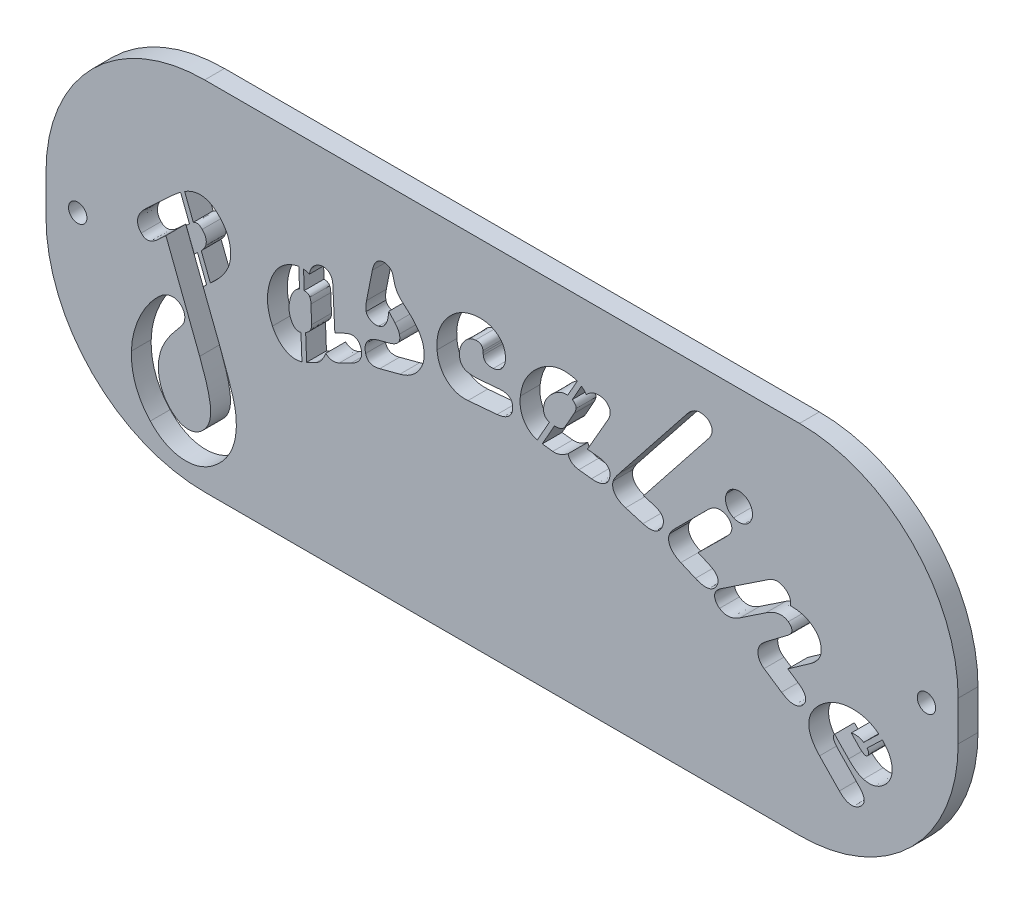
from build123d import *

# Parameters (mm, degrees)
SKETCH1_W                 = 146.05
SKETCH1_H                 = 57.15
BOSS_EXTRUDE1_DEPTH       = 3.175
F_4_CLEARANCE_HOLE1_D     = 2.9464
F_4_CLEARANCE_HOLE1_DEPTH = 3.302
CUT_EXTRUDE3_DEPTH        = 157.865565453
BOSS_EXTRUDE2_DEPTH       = 3.175
FILLET1_R                 = 25.4


with BuildPart() as part:
    # Sketch1 → Boss-Extrude1 (new body)
    with BuildSketch(Plane.XY):
        with Locations((73.025, 28.575)):
            Rectangle(SKETCH1_W, SKETCH1_H)
    extrude(amount=BOSS_EXTRUDE1_DEPTH)

    # 4 Clearance Hole1
    with Locations(Plane(origin=(-66.675, -37.192315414, 3.175), x_dir=(1, 0, 0), z_dir=(0, 0, 1))):
        with Locations((71.755, 65.767315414), (207.645, 65.767315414)):
            Hole(F_4_CLEARANCE_HOLE1_D / 2, depth=F_4_CLEARANCE_HOLE1_DEPTH)

    # Sketch4 → Cut-Extrude3 (cut, through all)
    # profile 1 of 10: a face of its own
    with BuildSketch(Plane.XY.offset(3.175)):
        with BuildLine():
            Line((25.159109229, 28.355996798), (27.774034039, 21.614245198))
            add(Edge.make_bspline(
                [(27.774034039, 21.614245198), (27.928592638, 21.212021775), (28.22559931, 20.43909137), (28.639687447, 19.321879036), (29.005343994, 18.294136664), (29.330097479, 17.356375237), (29.610885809, 16.508972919), (29.845041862, 15.74957907), (30.036613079, 15.082912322), (30.227486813, 14.317114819), (30.398002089, 13.419954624), (30.482906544, 12.356269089), (30.487862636, 11.29527412), (30.399752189, 10.596161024), (30.355677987, 10.246453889)],
                knots=[0, 0, 0, 0, 1.315063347, 2.527084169, 3.636212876, 4.644213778, 5.555804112, 6.360533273, 7.069422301, 7.672385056, 8.769052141, 9.851548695, 10.925311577, 12, 12, 12, 12], degree=3))
            add(Edge.make_bspline(
                [(30.355677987, 10.246453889), (30.313050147, 9.993388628), (30.228806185, 9.493264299), (30.017336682, 8.766558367), (29.758929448, 8.064648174), (29.43110879, 7.392389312), (29.052764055, 6.7446787), (28.609879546, 6.12761609), (28.112160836, 5.536003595), (27.739166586, 5.172080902), (27.550576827, 4.988077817)],
                knots=[0, 0, 0, 0, 1.012748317, 2.001460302, 2.983832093, 3.963628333, 4.951210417, 5.942929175, 6.959923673, 8, 8, 8, 8], degree=3))
            add(Edge.make_bspline(
                [(27.550576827, 4.988077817), (27.344473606, 4.805234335), (26.941194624, 4.447467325), (26.294794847, 3.984047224), (25.632578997, 3.597315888), (24.952060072, 3.283198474), (24.253038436, 3.052200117), (23.538346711, 2.890383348), (22.80592522, 2.818305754), (22.06392788, 2.811778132), (21.322927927, 2.88308937), (20.59732186, 3.029797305), (19.89430284, 3.256873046), (19.210023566, 3.552419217), (18.546341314, 3.926312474), (17.904960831, 4.375579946), (17.281095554, 4.895773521), (16.897263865, 5.290319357), (16.701016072, 5.492045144)],
                knots=[0, 0, 0, 0, 1.082409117, 2.117933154, 3.120093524, 4.092919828, 5.058157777, 6.008813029, 6.967091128, 7.945108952, 8.92135959, 9.887702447, 10.849073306, 11.819983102, 12.81286572, 13.837597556, 14.894393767, 16, 16, 16, 16], degree=3))
            add(Edge.make_bspline(
                [(16.701016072, 5.492045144), (16.449000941, 5.775385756), (15.95076111, 6.335556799), (15.321022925, 7.257251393), (14.781420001, 8.215712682), (14.354234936, 9.224777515), (14.023624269, 10.277085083), (13.796504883, 11.374147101), (13.66842817, 12.517522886), (13.671098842, 13.293713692), (13.672457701, 13.68864582)],
                knots=[0, 0, 0, 0, 1.013454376, 2.0036231, 2.979089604, 3.951566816, 4.929021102, 5.925080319, 6.944264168, 8, 8, 8, 8], degree=3))
            add(Edge.make_bspline(
                [(13.672457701, 13.68864582), (13.695132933, 14.125689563), (13.74107588, 15.011196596), (14.009816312, 16.336112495), (14.396218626, 17.675928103), (14.84885246, 18.777846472), (15.268306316, 19.649996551), (15.609048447, 20.284781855), (15.973267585, 20.894455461), (16.36055615, 21.475079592), (16.771537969, 22.03179843), (17.209066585, 22.556291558), (17.664195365, 23.059560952), (17.989127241, 23.370506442), (18.151110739, 23.525517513)],
                knots=[0, 0, 0, 0, 1.420880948, 2.878888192, 4.381990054, 5.949030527, 6.74398471, 7.527674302, 8.290164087, 9.051748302, 9.795685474, 10.538426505, 11.271383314, 12, 12, 12, 12], degree=3))
            add(Edge.make_bspline(
                [(18.151110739, 23.525517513), (18.305740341, 23.662119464), (18.601380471, 23.923292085), (19.087989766, 24.219471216), (19.573683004, 24.428991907), (20.060437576, 24.527115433), (20.530947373, 24.539662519), (20.97079938, 24.435677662), (21.374646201, 24.233766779), (21.591669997, 24.026253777), (21.702654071, 23.920133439)],
                knots=[0, 0, 0, 0, 1.236261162, 2.363638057, 3.404192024, 4.394848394, 5.327151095, 6.206300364, 7.082717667, 8, 8, 8, 8], degree=3))
            add(Edge.make_bspline(
                [(21.702654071, 23.920133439), (21.804705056, 23.796225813), (22.004335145, 23.553840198), (22.183440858, 23.114517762), (22.248128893, 22.637895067), (22.202014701, 22.317621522), (22.178094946, 22.151493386)],
                knots=[0, 0, 0, 0, 1.006687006, 1.969260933, 2.946641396, 4, 4, 4, 4], degree=3))
            add(Edge.make_bspline(
                [(22.178094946, 22.151493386), (22.145426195, 22.040604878), (22.071353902, 21.789179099), (21.848054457, 21.405112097), (21.529045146, 20.967538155), (21.272362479, 20.66629593), (21.132125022, 20.501713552)],
                knots=[0, 0, 0, 0, 0.701886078, 1.591438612, 2.684092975, 4, 4, 4, 4], degree=3))
            add(Edge.make_bspline(
                [(21.132125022, 20.501713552), (20.955764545, 20.300548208), (20.611958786, 19.908386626), (20.141213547, 19.304353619), (19.710252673, 18.713437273), (19.335223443, 18.120240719), (19.000432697, 17.536430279), (18.713170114, 16.956524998), (18.479691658, 16.380007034), (18.354913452, 15.993725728), (18.293743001, 15.804357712)],
                knots=[0, 0, 0, 0, 1.160307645, 2.261960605, 3.320911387, 4.331723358, 5.30469974, 6.239396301, 7.136893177, 8, 8, 8, 8], degree=3))
            add(Edge.make_bspline(
                [(18.293743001, 15.804357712), (18.216269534, 15.492039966), (18.063542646, 14.876354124), (17.970292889, 13.931589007), (17.992948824, 12.992339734), (18.136823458, 12.068039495), (18.386001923, 11.178753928), (18.744520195, 10.347941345), (19.202132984, 9.577224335), (19.58794118, 9.127178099), (19.781872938, 8.900956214)],
                knots=[0, 0, 0, 0, 1.045849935, 2.061730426, 3.077846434, 4.095152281, 5.097357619, 6.074348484, 7.032044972, 8, 8, 8, 8], degree=3))
            add(Edge.make_bspline(
                [(19.781872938, 8.900956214), (19.88427223, 8.792418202), (20.083983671, 8.580734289), (20.413683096, 8.309693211), (20.732510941, 8.054928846), (21.069000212, 7.855395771), (21.401415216, 7.676363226), (21.747988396, 7.55336879), (22.093720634, 7.447598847), (22.447236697, 7.393030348), (22.797701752, 7.373077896), (23.142242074, 7.391930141), (23.47735853, 7.449018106), (23.804027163, 7.545831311), (24.123026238, 7.67931028), (24.434977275, 7.851500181), (24.733759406, 8.06694053), (24.921153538, 8.23213368), (25.016476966, 8.316163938)],
                knots=[0, 0, 0, 0, 1.203491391, 2.347193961, 3.442629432, 4.493898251, 5.501177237, 6.485183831, 7.457218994, 8.416536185, 9.364865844, 10.287640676, 11.196468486, 12.103492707, 13.032722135, 13.983552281, 14.974275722, 16, 16, 16, 16], degree=3))
            add(Edge.make_bspline(
                [(25.016476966, 8.316163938), (25.131569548, 8.43106494), (25.358676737, 8.657794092), (25.651780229, 9.036265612), (25.889436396, 9.445866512), (26.086797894, 9.877796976), (26.229026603, 10.339935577), (26.323967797, 10.827617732), (26.370577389, 11.343670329), (26.368872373, 11.892450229), (26.319191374, 12.488482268), (26.214610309, 13.141278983), (26.07302369, 13.862338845), (25.875454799, 14.647037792), (25.626112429, 15.497474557), (25.330384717, 16.415088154), (24.987993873, 17.399529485), (24.734305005, 18.074346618), (24.602843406, 18.42403693)],
                knots=[0, 0, 0, 0, 0.7264417, 1.433455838, 2.132009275, 2.839023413, 3.551481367, 4.287768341, 5.056071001, 5.863602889, 6.737762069, 7.726554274, 8.817085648, 10.021424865, 11.341811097, 12.77775923, 14.330234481, 16, 16, 16, 16], degree=3))
            Line((24.602843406, 18.42403693), (19.197080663, 32.463805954))
            Line((19.197080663, 32.463805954), (17.91814471, 31.270449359))
            add(Edge.make_bspline(
                [(17.91814471, 31.270449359), (17.787773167, 31.152930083), (17.543663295, 30.932885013), (17.157427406, 30.672414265), (16.79353877, 30.4863947), (16.442881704, 30.382692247), (16.109621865, 30.373324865), (15.793633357, 30.439383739), (15.499337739, 30.598877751), (15.336175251, 30.755803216), (15.250921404, 30.837798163)],
                knots=[0, 0, 0, 0, 1.374982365, 2.574540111, 3.641697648, 4.570405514, 5.415885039, 6.230094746, 7.075208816, 8, 8, 8, 8], degree=3))
            add(Edge.make_bspline(
                [(15.250921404, 30.837798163), (15.141065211, 30.966235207), (14.92891685, 31.214265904), (14.730197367, 31.654659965), (14.646936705, 32.116636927), (14.678187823, 32.597334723), (14.826658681, 33.087163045), (15.087433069, 33.575607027), (15.448603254, 34.066653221), (15.751794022, 34.3650202), (15.91178422, 34.52246494)],
                knots=[0, 0, 0, 0, 0.955637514, 1.845475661, 2.704955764, 3.597337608, 4.553948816, 5.588185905, 6.727314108, 8, 8, 8, 8], degree=3))
            Line((15.91178422, 34.52246494), (20.385682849, 38.696835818))
            add(Edge.make_bspline(
                [(20.385682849, 38.696835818), (20.564659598, 38.858835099), (20.911743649, 39.172995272), (21.443653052, 39.597665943), (21.968073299, 39.958340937), (22.474216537, 40.267486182), (22.976016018, 40.506437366), (23.462776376, 40.694534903), (23.941069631, 40.820571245), (24.40905349, 40.883574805), (24.867343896, 40.888589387), (25.320252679, 40.837215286), (25.765068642, 40.719669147), (26.206363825, 40.547703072), (26.639231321, 40.312476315), (27.063761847, 40.018170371), (27.485843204, 39.671713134), (27.745034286, 39.401756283), (27.878631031, 39.262610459)],
                knots=[0, 0, 0, 0, 1.343999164, 2.606375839, 3.786202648, 4.886419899, 5.904706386, 6.876588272, 7.78836262, 8.65197827, 9.499162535, 10.334312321, 11.181864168, 12.053646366, 12.965676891, 13.917808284, 14.926760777, 16, 16, 16, 16], degree=3))
            add(Edge.make_bspline(
                [(27.878631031, 39.262610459), (28.036377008, 39.083580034), (28.345059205, 38.733247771), (28.733599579, 38.159921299), (29.047464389, 37.564517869), (29.295022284, 36.945808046), (29.460889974, 36.301731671), (29.549778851, 35.634841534), (29.571383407, 34.945966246), (29.527155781, 34.48261064), (29.504638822, 34.246709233)],
                knots=[0, 0, 0, 0, 1.048692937, 2.052114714, 3.037432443, 4.004357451, 4.976494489, 5.954412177, 6.958560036, 8, 8, 8, 8], degree=3))
            add(Edge.make_bspline(
                [(29.504638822, 34.246709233), (29.475951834, 34.071292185), (29.417128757, 33.711597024), (29.237058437, 33.178088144), (29.002141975, 32.634126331), (28.683852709, 32.090417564), (28.311968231, 31.532915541), (27.857810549, 30.978046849), (27.344708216, 30.40874864), (26.963483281, 30.043004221), (26.766099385, 29.853635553)],
                knots=[0, 0, 0, 0, 0.807226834, 1.655230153, 2.552533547, 3.498462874, 4.516077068, 5.597914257, 6.756290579, 8, 8, 8, 8], degree=3))
            Line((26.766099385, 29.853635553), (25.159109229, 28.355996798))
        make_face()
        with BuildLine():
            Line((23.742295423, 32.154769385), (24.693177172, 33.039089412))
            add(Edge.make_bspline(
                [(24.693177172, 33.039089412), (24.827427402, 33.171554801), (25.080799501, 33.421558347), (25.375163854, 33.834319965), (25.574036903, 34.243654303), (25.670433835, 34.655194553), (25.660321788, 35.065601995), (25.546037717, 35.471871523), (25.322693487, 35.867702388), (25.119179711, 36.107458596), (25.011722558, 36.234052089)],
                knots=[0, 0, 0, 0, 1.230332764, 2.32202204, 3.294685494, 4.186386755, 5.056363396, 5.948124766, 6.916590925, 8, 8, 8, 8], degree=3))
            add(Edge.make_bspline(
                [(25.011722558, 36.234052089), (24.944127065, 36.301400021), (24.817302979, 36.427759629), (24.603001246, 36.573114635), (24.380714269, 36.654365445), (24.154481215, 36.686606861), (23.923946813, 36.655072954), (23.694010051, 36.565469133), (23.460123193, 36.422635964), (23.315681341, 36.296726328), (23.238328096, 36.22929768)],
                knots=[0, 0, 0, 0, 1.125045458, 2.110833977, 3.028222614, 3.896017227, 4.782364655, 5.74134233, 6.790416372, 8, 8, 8, 8], degree=3))
            Line((23.238328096, 36.22929768), (22.449096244, 35.497118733))
            Line((22.449096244, 35.497118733), (23.742295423, 32.154769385))
        make_face(mode=Mode.SUBTRACT)
    # profile 2 of 10: a face of its own
    with BuildSketch(Plane.XY.offset(3.175)):
        with BuildLine():
            Line((46.248164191, 32.473701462), (47.836136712, 33.23916127))
            add(Edge.make_bspline(
                [(47.836136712, 33.23916127), (47.98043128, 33.304864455), (48.250878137, 33.428009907), (48.655919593, 33.544130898), (49.024797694, 33.597663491), (49.361655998, 33.577213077), (49.661082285, 33.480110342), (49.922246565, 33.311225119), (50.146848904, 33.071734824), (50.252768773, 32.872940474), (50.308429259, 32.768474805)],
                knots=[0, 0, 0, 0, 1.325887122, 2.485069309, 3.515349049, 4.433298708, 5.285091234, 6.120605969, 7.01238563, 8, 8, 8, 8], degree=3))
            add(Edge.make_bspline(
                [(50.308429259, 32.768474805), (50.371678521, 32.616843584), (50.49372178, 32.324262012), (50.571280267, 31.860402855), (50.523509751, 31.407619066), (50.378304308, 30.972256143), (50.13097406, 30.563984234), (49.784405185, 30.193916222), (49.344373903, 29.86412626), (49.006974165, 29.686040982), (48.829808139, 29.592529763)],
                knots=[0, 0, 0, 0, 0.994521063, 1.918988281, 2.81709464, 3.728983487, 4.681799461, 5.688554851, 6.786277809, 8, 8, 8, 8], degree=3))
            Line((48.829808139, 29.592529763), (46.985097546, 28.698700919))
            add(Edge.make_bspline(
                [(46.985097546, 28.698700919), (46.884780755, 28.65291578), (46.691619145, 28.56475575), (46.391572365, 28.484687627), (46.101920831, 28.442622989), (45.820124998, 28.456090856), (45.544959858, 28.49869255), (45.282176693, 28.604391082), (45.026529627, 28.746810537), (44.872408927, 28.87211557), (44.793315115, 28.936421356)],
                knots=[0, 0, 0, 0, 1.122270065, 2.160949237, 3.154938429, 4.092575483, 5.027564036, 5.97874467, 6.962703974, 8, 8, 8, 8], degree=3))
            add(Edge.make_bspline(
                [(44.793315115, 28.936421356), (44.743865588, 28.810715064), (44.648221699, 28.567577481), (44.48822878, 28.221683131), (44.306037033, 27.913932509), (44.116424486, 27.635517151), (43.913480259, 27.390433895), (43.690321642, 27.187271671), (43.464084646, 27.003463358), (43.294257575, 26.916235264), (43.210097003, 26.873007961)],
                knots=[0, 0, 0, 0, 1.216709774, 2.353325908, 3.428112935, 4.433851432, 5.38609751, 6.284954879, 7.150081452, 8, 8, 8, 8], degree=3))
            Line((43.210097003, 26.873007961), (41.569825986, 26.0790217))
            add(Edge.make_bspline(
                [(41.569825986, 26.0790217), (41.444060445, 26.022535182), (41.198409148, 25.912203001), (40.818943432, 25.793432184), (40.443174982, 25.714175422), (40.067929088, 25.688874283), (39.694322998, 25.694148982), (39.322270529, 25.756372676), (38.948934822, 25.847844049), (38.584473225, 25.994267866), (38.22760134, 26.172441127), (37.89034616, 26.393780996), (37.568014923, 26.645873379), (37.271926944, 26.939957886), (36.979817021, 27.256727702), (36.72366789, 27.62327366), (36.47240421, 28.014816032), (36.331083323, 28.297882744), (36.259151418, 28.441962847)],
                knots=[0, 0, 0, 0, 1.012412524, 1.977492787, 2.916281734, 3.827426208, 4.736185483, 5.655334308, 6.593183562, 7.555659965, 8.534903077, 9.520222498, 10.515200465, 11.536550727, 12.584062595, 13.676703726, 14.817449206, 16, 16, 16, 16], degree=3))
            add(Edge.make_bspline(
                [(36.259151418, 28.441962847), (36.156049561, 28.666673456), (35.952118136, 29.111142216), (35.732595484, 29.808113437), (35.566587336, 30.511460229), (35.478196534, 31.227119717), (35.454311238, 31.951065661), (35.496388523, 32.686724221), (35.614403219, 33.431649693), (35.786665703, 34.178363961), (36.022450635, 34.897384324), (36.298597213, 35.574606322), (36.637898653, 36.184761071), (37.007547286, 36.747431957), (37.44406621, 37.237634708), (37.914281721, 37.681306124), (38.439330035, 38.059572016), (38.820775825, 38.259471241), (39.011954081, 38.359659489)],
                knots=[0, 0, 0, 0, 1.046473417, 2.069883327, 3.089453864, 4.104615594, 5.118999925, 6.154735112, 7.221093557, 8.31062005, 9.397723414, 10.423948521, 11.403470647, 12.351324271, 13.269684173, 14.177081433, 15.086364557, 16, 16, 16, 16], degree=3))
            add(Edge.make_bspline(
                [(39.011954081, 38.359659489), (39.15991078, 38.427038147), (39.445201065, 38.556957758), (39.877514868, 38.707273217), (40.295324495, 38.805361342), (40.699119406, 38.867917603), (41.089486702, 38.872196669), (41.463871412, 38.827381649), (41.826468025, 38.746392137), (42.051336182, 38.647155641), (42.164127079, 38.597379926)],
                knots=[0, 0, 0, 0, 1.19188147, 2.298187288, 3.349656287, 4.335829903, 5.288918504, 6.201462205, 7.097877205, 8, 8, 8, 8], degree=3))
            add(Edge.make_bspline(
                [(42.164127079, 38.597379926), (42.185614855, 38.710403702), (42.227329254, 38.92981771), (42.326180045, 39.242628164), (42.464407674, 39.524522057), (42.617737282, 39.789295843), (42.81039393, 40.025044), (43.036955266, 40.227467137), (43.286055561, 40.41387726), (43.47163887, 40.511141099), (43.566677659, 40.560950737)],
                knots=[0, 0, 0, 0, 1.096832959, 2.12929105, 3.116387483, 4.085852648, 5.041910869, 6.004755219, 6.978218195, 8, 8, 8, 8], degree=3))
            add(Edge.make_bspline(
                [(43.566677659, 40.560950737), (43.671507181, 40.606183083), (43.874456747, 40.693752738), (44.196094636, 40.756094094), (44.514454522, 40.757339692), (44.82291857, 40.692693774), (45.111157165, 40.583875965), (45.36181968, 40.415838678), (45.572173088, 40.200484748), (45.667361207, 40.023294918), (45.715670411, 39.933368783)],
                knots=[0, 0, 0, 0, 1.095858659, 2.121578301, 3.127961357, 4.138724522, 5.138268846, 6.072899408, 7.021971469, 8, 8, 8, 8], degree=3))
            add(Edge.make_bspline(
                [(45.715670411, 39.933368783), (45.746017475, 39.864297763), (45.810741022, 39.716984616), (45.873705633, 39.4701667), (45.916094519, 39.191391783), (45.928070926, 38.995327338), (45.934373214, 38.892153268)],
                knots=[0, 0, 0, 0, 0.844105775, 1.800290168, 2.842457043, 4, 4, 4, 4], degree=3))
            Line((45.934373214, 38.892153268), (45.953390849, 38.435730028))
            Line((45.953390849, 38.435730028), (46.248164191, 32.473701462))
        make_face()
        with BuildLine():
            Line((41.018314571, 29.94435601), (41.379649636, 30.115514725))
            add(Edge.make_bspline(
                [(41.379649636, 30.115514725), (41.472452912, 30.164601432), (41.651912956, 30.259523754), (41.89730393, 30.423336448), (42.09796882, 30.613274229), (42.267916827, 30.810969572), (42.394330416, 31.03050354), (42.479605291, 31.265420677), (42.529244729, 31.515949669), (42.529888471, 31.68741605), (42.530216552, 31.774803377)],
                knots=[0, 0, 0, 0, 1.171788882, 2.265968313, 3.279841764, 4.246958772, 5.166303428, 6.089723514, 7.026433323, 8, 8, 8, 8], degree=3))
            Line((42.530216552, 31.774803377), (42.420865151, 34.579904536))
            add(Edge.make_bspline(
                [(42.420865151, 34.579904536), (42.417672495, 34.667187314), (42.411610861, 34.832903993), (42.379131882, 35.065603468), (42.327933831, 35.268430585), (42.27797963, 35.388620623), (42.254460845, 35.445206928)],
                knots=[0, 0, 0, 0, 1.180604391, 2.241517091, 3.172094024, 4, 4, 4, 4], degree=3))
            add(Edge.make_bspline(
                [(42.254460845, 35.445206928), (42.222592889, 35.501357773), (42.158374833, 35.614508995), (42.002973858, 35.746447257), (41.804630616, 35.834783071), (41.576590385, 35.894656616), (41.325932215, 35.91847449), (41.06741346, 35.89858633), (40.805605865, 35.836031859), (40.638582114, 35.76326924), (40.552382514, 35.725717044)],
                knots=[0, 0, 0, 0, 0.812481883, 1.637256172, 2.525701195, 3.54278871, 4.610838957, 5.697198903, 6.811543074, 8, 8, 8, 8], degree=3))
            add(Edge.make_bspline(
                [(40.552382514, 35.725717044), (40.468803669, 35.680118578), (40.299742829, 35.587883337), (40.064849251, 35.411584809), (39.857431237, 35.194019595), (39.662435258, 34.947090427), (39.48944609, 34.664262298), (39.337195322, 34.344416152), (39.198242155, 33.994392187), (39.053498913, 33.489753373), (38.921655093, 32.859754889), (38.895670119, 32.118973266), (38.992374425, 31.421428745), (39.164763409, 30.998805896), (39.249674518, 30.790640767)],
                knots=[0, 0, 0, 0, 0.618779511, 1.251649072, 1.900352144, 2.568418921, 3.294989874, 4.051012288, 4.870229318, 5.740995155, 7.463265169, 9.041118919, 10.542587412, 12, 12, 12, 12], degree=3))
            add(Edge.make_bspline(
                [(39.249674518, 30.790640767), (39.305963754, 30.684654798), (39.411807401, 30.485363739), (39.596503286, 30.224668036), (39.797736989, 30.021172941), (40.019757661, 29.887326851), (40.252914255, 29.804956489), (40.501499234, 29.787168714), (40.763967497, 29.831283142), (40.930906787, 29.905497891), (41.018314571, 29.94435601)],
                knots=[0, 0, 0, 0, 1.286423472, 2.41893055, 3.416839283, 4.332416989, 5.176537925, 6.046295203, 6.977059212, 8, 8, 8, 8], degree=3))
        make_face(mode=Mode.SUBTRACT)
    # profile 3 of 10: a face of its own
    with BuildSketch(Plane.XY.offset(3.175)):
        with BuildLine():
            Line((54.88975039, 39.818585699), (54.789907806, 39.010336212))
            add(Edge.make_bspline(
                [(54.789907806, 39.010336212), (54.766276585, 38.871691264), (54.721144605, 38.606900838), (54.604072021, 38.23794422), (54.463738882, 37.909837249), (54.286261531, 37.626817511), (54.080208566, 37.385567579), (53.844718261, 37.185867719), (53.572694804, 37.035142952), (53.374442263, 36.973587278), (53.273251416, 36.942168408)],
                knots=[0, 0, 0, 0, 1.235818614, 2.360222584, 3.39637956, 4.367268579, 5.286645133, 6.177352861, 7.069695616, 8, 8, 8, 8], degree=3))
            add(Edge.make_bspline(
                [(53.273251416, 36.942168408), (53.169104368, 36.920662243), (52.962215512, 36.877940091), (52.642600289, 36.886224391), (52.324610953, 36.947193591), (52.020436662, 37.07208085), (51.744861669, 37.236413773), (51.517613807, 37.442240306), (51.344671, 37.681100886), (51.283162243, 37.864041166), (51.2526277, 37.954857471)],
                knots=[0, 0, 0, 0, 1.023881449, 2.033947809, 3.063303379, 4.134572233, 5.1922022, 6.145375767, 7.079316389, 8, 8, 8, 8], degree=3))
            add(Edge.make_bspline(
                [(51.2526277, 37.954857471), (51.233735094, 38.054384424), (51.19262741, 38.270941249), (51.196121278, 38.632704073), (51.234130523, 39.050824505), (51.289563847, 39.346679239), (51.319189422, 39.504794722)],
                knots=[0, 0, 0, 0, 0.776507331, 1.689572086, 2.765223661, 4, 4, 4, 4], degree=3))
            Line((51.319189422, 39.504794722), (52.251053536, 44.192641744))
            add(Edge.make_bspline(
                [(52.251053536, 44.192641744), (52.281878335, 44.326429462), (52.340962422, 44.582869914), (52.464970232, 44.941441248), (52.611880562, 45.25771462), (52.781329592, 45.53211764), (52.980991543, 45.759244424), (53.199083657, 45.948088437), (53.446574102, 46.089946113), (53.625397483, 46.146674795), (53.71541143, 46.175230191)],
                knots=[0, 0, 0, 0, 1.266077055, 2.426780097, 3.493007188, 4.478794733, 5.390787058, 6.272623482, 7.130494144, 8, 8, 8, 8], degree=3))
            add(Edge.make_bspline(
                [(53.71541143, 46.175230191), (53.813150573, 46.196674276), (54.004034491, 46.238554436), (54.295982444, 46.23259319), (54.577449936, 46.167733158), (54.844394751, 46.054945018), (55.086247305, 45.900825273), (55.284346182, 45.708995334), (55.435630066, 45.482432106), (55.489671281, 45.311725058), (55.517332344, 45.224348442)],
                knots=[0, 0, 0, 0, 1.060985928, 2.072098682, 3.073619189, 4.115705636, 5.139237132, 6.104378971, 7.029724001, 8, 8, 8, 8], degree=3))
            add(Edge.make_bspline(
                [(55.517332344, 45.224348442), (55.524982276, 45.194161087), (55.543597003, 45.120705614), (55.585308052, 44.992634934), (55.623922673, 44.819495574), (55.659295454, 44.691676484), (55.678982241, 44.620538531)],
                knots=[0, 0, 0, 0, 0.597680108, 1.454346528, 2.583211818, 4, 4, 4, 4], degree=3))
            add(Edge.make_bspline(
                [(55.678982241, 44.620538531), (55.707456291, 44.51275801), (55.76106673, 44.309830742), (55.815234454, 44.107051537), (55.840632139, 44.011974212)],
                knots=[0, 0, 0, 0, 1.062257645, 2, 2, 2, 2], degree=3))
            add(Edge.make_bspline(
                [(55.840632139, 44.011974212), (55.892402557, 43.849737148), (55.998197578, 43.518198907), (56.263583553, 43.048571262), (56.615011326, 42.59896268), (56.897251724, 42.327132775), (57.043497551, 42.186281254)],
                knots=[0, 0, 0, 0, 0.920137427, 1.880339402, 2.90167559, 4, 4, 4, 4], degree=3))
            Line((57.043497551, 42.186281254), (58.18455565, 41.173592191))
            add(Edge.make_bspline(
                [(58.18455565, 41.173592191), (58.32585068, 41.045546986), (58.60260209, 40.794747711), (58.97775661, 40.394494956), (59.310732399, 39.986911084), (59.613723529, 39.582325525), (59.865668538, 39.162281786), (60.085636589, 38.741705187), (60.265673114, 38.311323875), (60.349122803, 38.0160456), (60.390601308, 37.869278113)],
                knots=[0, 0, 0, 0, 1.134947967, 2.222997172, 3.26199006, 4.267893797, 5.229126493, 6.174435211, 7.092606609, 8, 8, 8, 8], degree=3))
            add(Edge.make_bspline(
                [(60.390601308, 37.869278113), (60.428526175, 37.708231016), (60.503057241, 37.391736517), (60.561014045, 36.912081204), (60.56447553, 36.440475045), (60.523851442, 35.976091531), (60.425974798, 35.522490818), (60.284305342, 35.076596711), (60.084693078, 34.642447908), (59.846153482, 34.217051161), (59.560579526, 33.817007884), (59.247666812, 33.442931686), (58.898637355, 33.107939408), (58.513286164, 32.812960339), (58.100597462, 32.544493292), (57.650813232, 32.316458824), (57.169407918, 32.125979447), (56.833594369, 32.028197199), (56.663144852, 31.978565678)],
                knots=[0, 0, 0, 0, 1.019417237, 2.003388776, 2.970631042, 3.922355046, 4.870814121, 5.825492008, 6.800596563, 7.811221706, 8.827685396, 9.82590976, 10.813995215, 11.802804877, 12.813618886, 13.844765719, 14.906063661, 16, 16, 16, 16], degree=3))
            Line((56.663144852, 31.978565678), (53.434901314, 31.127526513))
            add(Edge.make_bspline(
                [(53.434901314, 31.127526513), (53.286684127, 31.091147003), (53.010125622, 31.023266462), (52.606344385, 30.996346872), (52.246991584, 31.015887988), (51.933576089, 31.115724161), (51.662174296, 31.266685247), (51.448855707, 31.494356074), (51.271572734, 31.773146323), (51.206124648, 31.992108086), (51.171802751, 32.106934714)],
                knots=[0, 0, 0, 0, 1.299323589, 2.424408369, 3.441644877, 4.348188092, 5.208486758, 6.059385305, 6.982314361, 8, 8, 8, 8], degree=3))
            add(Edge.make_bspline(
                [(51.171802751, 32.106934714), (51.136085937, 32.27089349), (51.067528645, 32.585607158), (51.083401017, 33.05694867), (51.194068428, 33.49509638), (51.408376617, 33.89541329), (51.717111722, 34.248743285), (52.111204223, 34.546530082), (52.585648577, 34.786133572), (52.936849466, 34.89365763), (53.121110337, 34.950071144)],
                knots=[0, 0, 0, 0, 1.030032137, 1.977114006, 2.874205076, 3.790985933, 4.745779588, 5.741251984, 6.81492648, 8, 8, 8, 8], degree=3))
            Line((53.121110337, 34.950071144), (54.913522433, 35.425512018))
            add(Edge.make_bspline(
                [(54.913522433, 35.425512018), (55.074764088, 35.47266499), (55.377705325, 35.561256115), (55.787180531, 35.739291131), (56.11733985, 35.954606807), (56.372997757, 36.199519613), (56.552366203, 36.479077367), (56.649754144, 36.792273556), (56.6622974, 37.137341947), (56.613038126, 37.367573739), (56.587074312, 37.488925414)],
                knots=[0, 0, 0, 0, 1.332564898, 2.503626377, 3.529215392, 4.445304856, 5.293239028, 6.136589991, 7.017824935, 8, 8, 8, 8], degree=3))
            add(Edge.make_bspline(
                [(56.587074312, 37.488925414), (56.55654653, 37.585127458), (56.492512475, 37.786917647), (56.333053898, 38.08413683), (56.123794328, 38.392769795), (55.953679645, 38.591993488), (55.864404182, 38.696545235)],
                knots=[0, 0, 0, 0, 0.85180041, 1.78670804, 2.838473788, 4, 4, 4, 4], degree=3))
            Line((55.864404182, 38.696545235), (54.88975039, 39.818585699))
        make_face()
    # profile 4 of 10: a face of its own
    with BuildSketch(Plane.XY.offset(3.175)):
        with BuildLine():
            Line((72.214900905, 34.173657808), (67.560334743, 33.774287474))
            add(Edge.make_bspline(
                [(67.560334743, 33.774287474), (67.397128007, 33.764838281), (67.075389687, 33.746210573), (66.601129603, 33.772172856), (66.143832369, 33.834404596), (65.711092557, 33.958590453), (65.292868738, 34.112951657), (64.898093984, 34.31915721), (64.52261883, 34.570185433), (64.168808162, 34.863123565), (63.843432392, 35.192561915), (63.554175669, 35.554755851), (63.301999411, 35.94469922), (63.088257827, 36.364201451), (62.911549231, 36.811862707), (62.767556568, 37.286550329), (62.669409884, 37.793618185), (62.630747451, 38.141680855), (62.61099524, 38.319502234)],
                knots=[0, 0, 0, 0, 1.038947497, 2.048133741, 3.016006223, 3.967203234, 4.905063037, 5.847245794, 6.792120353, 7.772922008, 8.763617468, 9.731699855, 10.715810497, 11.712028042, 12.720861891, 13.7731687, 14.862336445, 16, 16, 16, 16], degree=3))
            add(Edge.make_bspline(
                [(62.61099524, 38.319502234), (62.596721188, 38.560327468), (62.568539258, 39.03580001), (62.609441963, 39.743015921), (62.713166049, 40.431041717), (62.885561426, 41.099974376), (63.124556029, 41.752139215), (63.435269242, 42.382661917), (63.809470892, 42.997855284), (64.247596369, 43.583370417), (64.731033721, 44.130698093), (65.250579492, 44.61713875), (65.797028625, 45.040911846), (66.37338248, 45.39873918), (66.980609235, 45.690868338), (67.615375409, 45.913898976), (68.278231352, 46.074626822), (68.732313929, 46.127778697), (68.962885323, 46.154767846)],
                knots=[0, 0, 0, 0, 1.035618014, 2.044669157, 3.036392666, 4.020515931, 5.006991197, 6.014801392, 7.035271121, 8.09596141, 9.152075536, 10.168380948, 11.148823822, 12.117998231, 13.077173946, 14.037508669, 15.003497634, 16, 16, 16, 16], degree=3))
            add(Edge.make_bspline(
                [(68.962885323, 46.154767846), (69.118136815, 46.165214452), (69.422143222, 46.185670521), (69.86852546, 46.173127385), (70.29696763, 46.139210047), (70.703262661, 46.060480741), (71.094674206, 45.957874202), (71.462708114, 45.813925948), (71.813926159, 45.642582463), (72.141307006, 45.437566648), (72.442917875, 45.207592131), (72.713057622, 44.954603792), (72.943028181, 44.675542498), (73.137605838, 44.374925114), (73.302300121, 44.054420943), (73.425688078, 43.709144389), (73.511184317, 43.341866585), (73.540661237, 43.088559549), (73.555644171, 42.959805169)],
                knots=[0, 0, 0, 0, 1.189561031, 2.329344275, 3.412606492, 4.473040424, 5.490545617, 6.503636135, 7.490345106, 8.475936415, 9.453066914, 10.387766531, 11.300430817, 12.211644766, 13.122455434, 14.050448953, 15.00905541, 16, 16, 16, 16], degree=3))
            add(Edge.make_bspline(
                [(73.555644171, 42.959805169), (73.565355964, 42.783685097), (73.584186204, 42.442205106), (73.504124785, 41.948099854), (73.351441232, 41.494133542), (73.118921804, 41.093190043), (72.825903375, 40.749776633), (72.468249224, 40.492760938), (72.061666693, 40.312927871), (71.766628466, 40.274291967), (71.615845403, 40.254546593)],
                knots=[0, 0, 0, 0, 1.134135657, 2.198980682, 3.203717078, 4.206009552, 5.168951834, 6.090526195, 7.024138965, 8, 8, 8, 8], degree=3))
            add(Edge.make_bspline(
                [(71.615845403, 40.254546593), (71.498594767, 40.248593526), (71.277953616, 40.237391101), (70.965115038, 40.263402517), (70.695423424, 40.33291336), (70.467504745, 40.444700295), (70.280537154, 40.598476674), (70.14636729, 40.801479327), (70.052889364, 41.041510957), (70.030298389, 41.217208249), (70.018364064, 41.310025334)],
                knots=[0, 0, 0, 0, 1.288980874, 2.425592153, 3.435055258, 4.330562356, 5.195587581, 6.060086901, 6.975185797, 8, 8, 8, 8], degree=3))
            add(Edge.make_bspline(
                [(70.018364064, 41.310025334), (70.013875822, 41.365518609), (70.005662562, 41.467068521), (69.99477536, 41.568365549), (69.989837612, 41.614307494)],
                knots=[0, 0, 0, 0, 1.092926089, 2, 2, 2, 2], degree=3))
            add(Edge.make_bspline(
                [(69.989837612, 41.614307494), (69.987157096, 41.663477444), (69.981960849, 41.758794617), (69.971250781, 41.853648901), (69.966065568, 41.899572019)],
                knots=[0, 0, 0, 0, 1.031712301, 2, 2, 2, 2], degree=3))
            add(Edge.make_bspline(
                [(69.966065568, 41.899572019), (69.955540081, 41.974386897), (69.935449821, 42.117187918), (69.87281703, 42.317061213), (69.763323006, 42.477243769), (69.626019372, 42.608687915), (69.449446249, 42.695416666), (69.246459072, 42.760429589), (69.008933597, 42.780690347), (68.842348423, 42.770367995), (68.753691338, 42.76487441)],
                knots=[0, 0, 0, 0, 1.062910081, 2.028802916, 2.913024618, 3.764894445, 4.672418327, 5.652613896, 6.750714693, 8, 8, 8, 8], degree=3))
            add(Edge.make_bspline(
                [(68.753691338, 42.76487441), (68.578566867, 42.736898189), (68.227648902, 42.68083887), (67.729790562, 42.436513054), (67.277560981, 42.065943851), (66.874173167, 41.591932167), (66.541509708, 41.051802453), (66.306932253, 40.472708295), (66.185645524, 39.867978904), (66.20190065, 39.460982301), (66.21008266, 39.256120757)],
                knots=[0, 0, 0, 0, 0.891450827, 1.786307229, 2.759854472, 3.826586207, 4.914920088, 5.949161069, 6.967711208, 8, 8, 8, 8], degree=3))
            add(Edge.make_bspline(
                [(66.21008266, 39.256120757), (66.23075398, 39.094222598), (66.269654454, 38.789553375), (66.445161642, 38.380466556), (66.706757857, 38.055015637), (67.066006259, 37.816341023), (67.528749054, 37.671064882), (68.095596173, 37.585524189), (68.781400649, 37.566361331), (69.275297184, 37.6015413), (69.54292319, 37.620604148)],
                knots=[0, 0, 0, 0, 0.919244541, 1.729887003, 2.481373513, 3.249293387, 4.130546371, 5.201474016, 6.483572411, 8, 8, 8, 8], degree=3))
            Line((69.54292319, 37.620604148), (72.576235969, 37.882096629))
            add(Edge.make_bspline(
                [(72.576235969, 37.882096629), (72.73471377, 37.893092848), (73.031538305, 37.91368846), (73.450535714, 37.873581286), (73.812220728, 37.79333721), (74.119043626, 37.654823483), (74.361941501, 37.454206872), (74.549801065, 37.204734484), (74.670128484, 36.899092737), (74.700007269, 36.677108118), (74.715719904, 36.560370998)],
                knots=[0, 0, 0, 0, 1.329339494, 2.489816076, 3.514313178, 4.423479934, 5.282352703, 6.127141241, 7.015102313, 8, 8, 8, 8], degree=3))
            add(Edge.make_bspline(
                [(74.715719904, 36.560370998), (74.72155392, 36.399811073), (74.732782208, 36.090793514), (74.627983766, 35.644133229), (74.429364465, 35.243803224), (74.132214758, 34.899311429), (73.756570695, 34.611706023), (73.305101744, 34.393049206), (72.784454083, 34.239658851), (72.41088433, 34.196368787), (72.214900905, 34.173657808)],
                knots=[0, 0, 0, 0, 0.985949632, 1.897582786, 2.792496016, 3.713643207, 4.674236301, 5.68702556, 6.786559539, 8, 8, 8, 8], degree=3))
        make_face()
    # profile 5 of 10: a face of its own
    with BuildSketch(Plane.XY.offset(3.175)):
        with BuildLine():
            Line((86.688564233, 36.593393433), (88.438186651, 36.393708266))
            add(Edge.make_bspline(
                [(88.438186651, 36.393708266), (88.595817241, 36.372151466), (88.892277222, 36.331609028), (89.300127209, 36.217352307), (89.645078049, 36.069442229), (89.917763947, 35.872295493), (90.122784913, 35.634930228), (90.25995005, 35.356153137), (90.321997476, 35.034626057), (90.305662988, 34.812175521), (90.29716047, 34.696384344)],
                knots=[0, 0, 0, 0, 1.330875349, 2.503012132, 3.536531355, 4.457598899, 5.295354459, 6.13814037, 7.03085458, 8, 8, 8, 8], degree=3))
            add(Edge.make_bspline(
                [(90.29716047, 34.696384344), (90.270993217, 34.53444726), (90.220976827, 34.224918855), (90.032363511, 33.798999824), (89.757687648, 33.440643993), (89.395895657, 33.157797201), (88.969284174, 32.945637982), (88.476305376, 32.828237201), (87.928348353, 32.771189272), (87.545909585, 32.805233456), (87.34467264, 32.823147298)],
                knots=[0, 0, 0, 0, 0.993681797, 1.899334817, 2.79907771, 3.710704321, 4.667034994, 5.67162828, 6.774825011, 8, 8, 8, 8], degree=3))
            Line((87.34467264, 32.823147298), (85.309785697, 33.051358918))
            add(Edge.make_bspline(
                [(85.309785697, 33.051358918), (85.201292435, 33.065444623), (84.990665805, 33.092790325), (84.695432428, 33.187877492), (84.426005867, 33.301771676), (84.19338116, 33.460911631), (83.985885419, 33.643480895), (83.818931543, 33.869337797), (83.678401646, 34.123346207), (83.612927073, 34.310107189), (83.579180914, 34.40636541)],
                knots=[0, 0, 0, 0, 1.117177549, 2.168865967, 3.163482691, 4.099094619, 5.040591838, 5.978029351, 6.95785888, 8, 8, 8, 8], degree=3))
            add(Edge.make_bspline(
                [(83.579180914, 34.40636541), (83.470886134, 34.325628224), (83.262094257, 34.169967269), (82.941839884, 33.968200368), (82.626300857, 33.805564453), (82.317630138, 33.677523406), (82.016419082, 33.578342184), (81.719225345, 33.523020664), (81.428779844, 33.494588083), (81.238419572, 33.509813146), (81.144923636, 33.517290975)],
                knots=[0, 0, 0, 0, 1.22069735, 2.353499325, 3.417065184, 4.425360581, 5.372253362, 6.276917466, 7.153703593, 8, 8, 8, 8], degree=3))
            Line((81.144923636, 33.517290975), (79.333493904, 33.721730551))
            add(Edge.make_bspline(
                [(79.333493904, 33.721730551), (79.191866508, 33.740868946), (78.913738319, 33.778452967), (78.51466001, 33.885578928), (78.138861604, 34.022375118), (77.79128957, 34.200836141), (77.464580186, 34.408620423), (77.169429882, 34.659867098), (76.89562696, 34.942094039), (76.649655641, 35.259140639), (76.437577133, 35.606551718), (76.255179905, 35.973117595), (76.110925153, 36.361823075), (76.009515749, 36.770565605), (75.935101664, 37.197839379), (75.905581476, 37.645121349), (75.902512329, 38.112531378), (75.932856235, 38.428737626), (75.948354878, 38.590245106)],
                knots=[0, 0, 0, 0, 1.027929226, 2.018649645, 2.968106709, 3.901872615, 4.82596919, 5.749220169, 6.685213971, 7.652868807, 8.63129316, 9.610980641, 10.59649728, 11.609308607, 12.639072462, 13.714532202, 14.832660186, 16, 16, 16, 16], degree=3))
            add(Edge.make_bspline(
                [(75.948354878, 38.590245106), (75.981286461, 38.83683879), (76.046503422, 39.325187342), (76.233375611, 40.037049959), (76.473444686, 40.722404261), (76.780851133, 41.380233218), (77.154743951, 42.008557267), (77.586286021, 42.613747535), (78.086901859, 43.18743802), (78.639768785, 43.727178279), (79.232276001, 44.213331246), (79.835425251, 44.644399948), (80.456300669, 44.985626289), (81.082708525, 45.256938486), (81.71989409, 45.446937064), (82.363230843, 45.568770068), (83.018617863, 45.609071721), (83.454140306, 45.573455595), (83.674269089, 45.555453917)],
                knots=[0, 0, 0, 0, 1.041785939, 2.063129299, 3.077798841, 4.082154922, 5.100535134, 6.138269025, 7.192996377, 8.287403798, 9.37256103, 10.402614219, 11.389668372, 12.335944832, 13.25842485, 14.170347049, 15.075227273, 16, 16, 16, 16], degree=3))
            add(Edge.make_bspline(
                [(83.674269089, 45.555453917), (83.838146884, 45.535235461), (84.154387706, 45.496219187), (84.604549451, 45.381564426), (85.020058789, 45.24712558), (85.397351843, 45.076505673), (85.734998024, 44.870841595), (86.029831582, 44.62908319), (86.299602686, 44.365109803), (86.438370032, 44.15721992), (86.507896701, 44.053060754)],
                knots=[0, 0, 0, 0, 1.192129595, 2.300494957, 3.350828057, 4.345152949, 5.28606443, 6.198307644, 7.097297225, 8, 8, 8, 8], degree=3))
            add(Edge.make_bspline(
                [(86.507896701, 44.053060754), (86.588299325, 44.139186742), (86.744130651, 44.306110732), (87.006848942, 44.516498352), (87.275205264, 44.695280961), (87.560485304, 44.826937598), (87.852026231, 44.931836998), (88.160176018, 44.986264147), (88.479548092, 45.00717981), (88.694981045, 44.98926111), (88.804276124, 44.980170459)],
                knots=[0, 0, 0, 0, 1.093850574, 2.120032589, 3.121163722, 4.083271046, 5.033689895, 5.992973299, 6.981779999, 8, 8, 8, 8], degree=3))
            add(Edge.make_bspline(
                [(88.804276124, 44.980170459), (88.920774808, 44.961749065), (89.145871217, 44.926155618), (89.46333166, 44.811878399), (89.737592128, 44.634855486), (89.974210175, 44.419121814), (90.162735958, 44.166436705), (90.286652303, 43.887044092), (90.355183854, 43.586973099), (90.34198313, 43.382979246), (90.33519574, 43.278092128)],
                knots=[0, 0, 0, 0, 1.107922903, 2.14070631, 3.145577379, 4.15826686, 5.13908242, 6.086483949, 7.016131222, 8, 8, 8, 8], degree=3))
            add(Edge.make_bspline(
                [(90.33519574, 43.278092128), (90.322792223, 43.201599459), (90.296813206, 43.041386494), (90.216759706, 42.795997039), (90.102315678, 42.53564479), (90.005477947, 42.361312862), (89.954843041, 42.270157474)],
                knots=[0, 0, 0, 0, 0.856552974, 1.794039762, 2.846538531, 4, 4, 4, 4], degree=3))
            Line((89.954843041, 42.270157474), (89.721877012, 41.866032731))
            Line((89.721877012, 41.866032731), (86.688564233, 36.593393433))
        make_face()
        with BuildLine():
            Line((80.916712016, 37.239993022), (81.316082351, 37.192448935))
            add(Edge.make_bspline(
                [(81.316082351, 37.192448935), (81.420646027, 37.183047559), (81.621882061, 37.164954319), (81.913612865, 37.188008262), (82.183846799, 37.23080161), (82.428491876, 37.318988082), (82.652481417, 37.437586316), (82.846139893, 37.598127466), (83.023939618, 37.785258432), (83.11428657, 37.933763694), (83.160792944, 38.010207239)],
                knots=[0, 0, 0, 0, 1.168772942, 2.249339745, 3.254868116, 4.210857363, 5.136289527, 6.066604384, 7.004778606, 8, 8, 8, 8], degree=3))
            Line((83.160792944, 38.010207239), (84.558589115, 40.492008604))
            add(Edge.make_bspline(
                [(84.558589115, 40.492008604), (84.600976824, 40.569083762), (84.680994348, 40.71458262), (84.776850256, 40.930421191), (84.84782387, 41.12849251), (84.867817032, 41.258628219), (84.877134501, 41.319275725)],
                knots=[0, 0, 0, 0, 1.182578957, 2.232416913, 3.17624834, 4, 4, 4, 4], degree=3))
            add(Edge.make_bspline(
                [(84.877134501, 41.319275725), (84.879345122, 41.386230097), (84.883753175, 41.519739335), (84.820549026, 41.718984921), (84.702428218, 41.907524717), (84.529488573, 42.078121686), (84.323326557, 42.23530492), (84.082813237, 42.357444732), (83.819443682, 42.451354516), (83.632213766, 42.479308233), (83.536391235, 42.493614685)],
                knots=[0, 0, 0, 0, 0.816289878, 1.627709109, 2.517465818, 3.520511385, 4.589159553, 5.684154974, 6.814772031, 8, 8, 8, 8], degree=3))
            add(Edge.make_bspline(
                [(83.536391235, 42.493614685), (83.438166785, 42.501312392), (83.239799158, 42.516858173), (82.936790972, 42.485658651), (82.633867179, 42.411045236), (82.324226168, 42.30958734), (82.021864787, 42.150400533), (81.709172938, 41.966084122), (81.395908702, 41.73644527), (80.990106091, 41.383205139), (80.535452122, 40.906238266), (80.099501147, 40.287918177), (79.807379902, 39.630488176), (79.725645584, 39.172690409), (79.685320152, 38.946825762)],
                knots=[0, 0, 0, 0, 0.623447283, 1.259073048, 1.919298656, 2.599023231, 3.317702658, 4.079050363, 4.898717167, 5.774607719, 7.486929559, 9.061028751, 10.54999357, 12, 12, 12, 12], degree=3))
            add(Edge.make_bspline(
                [(79.685320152, 38.946825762), (79.675637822, 38.824937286), (79.657383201, 38.595134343), (79.682011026, 38.267651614), (79.765095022, 37.98388853), (79.89180059, 37.738540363), (80.080662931, 37.543471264), (80.315382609, 37.394135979), (80.598733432, 37.28770875), (80.80643583, 37.256541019), (80.916712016, 37.239993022)],
                knots=[0, 0, 0, 0, 1.216169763, 2.292910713, 3.24624038, 4.142538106, 5.012781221, 5.914061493, 6.892505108, 8, 8, 8, 8], degree=3))
        make_face(mode=Mode.SUBTRACT)
    # profile 6 of 10: a face of its own
    with BuildSketch(Plane.XY.offset(3.175)):
        with BuildLine():
            Line((95.681625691, 34.641600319), (97.302879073, 34.166159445))
            add(Edge.make_bspline(
                [(97.302879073, 34.166159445), (97.451526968, 34.117274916), (97.729518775, 34.02585419), (98.104184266, 33.845793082), (98.404407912, 33.630704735), (98.63602479, 33.386181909), (98.790338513, 33.106386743), (98.860996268, 32.794689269), (98.860550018, 32.456569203), (98.805493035, 32.230364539), (98.776745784, 32.112254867)],
                knots=[0, 0, 0, 0, 1.301344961, 2.433692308, 3.443967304, 4.358564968, 5.214219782, 6.0682471, 6.991361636, 8, 8, 8, 8], degree=3))
            add(Edge.make_bspline(
                [(98.776745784, 32.112254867), (98.721211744, 31.952616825), (98.615441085, 31.648568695), (98.360616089, 31.247089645), (98.030732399, 30.934234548), (97.638524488, 30.699673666), (97.186582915, 30.564837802), (96.688582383, 30.512309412), (96.143406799, 30.55968667), (95.775538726, 30.65483525), (95.581783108, 30.704949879)],
                knots=[0, 0, 0, 0, 1.023874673, 1.950081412, 2.855255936, 3.76124842, 4.698634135, 5.695381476, 6.786160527, 8, 8, 8, 8], degree=3))
            Line((95.581783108, 30.704949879), (92.800453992, 31.517953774))
            add(Edge.make_bspline(
                [(92.800453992, 31.517953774), (92.614562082, 31.579328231), (92.26017207, 31.69633437), (91.783079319, 31.945762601), (91.385546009, 32.242296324), (91.070072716, 32.584953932), (90.853027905, 32.971478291), (90.728021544, 33.383798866), (90.714580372, 33.820824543), (90.779619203, 34.105265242), (90.813111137, 34.251738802)],
                knots=[0, 0, 0, 0, 1.235275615, 2.354967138, 3.384293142, 4.35553698, 5.274591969, 6.161730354, 7.05337773, 8, 8, 8, 8], degree=3))
            add(Edge.make_bspline(
                [(90.813111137, 34.251738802), (90.847058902, 34.343257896), (90.925535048, 34.554820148), (91.128398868, 34.884196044), (91.390850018, 35.284497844), (91.60784101, 35.560890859), (91.725957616, 35.711342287)],
                knots=[0, 0, 0, 0, 0.676101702, 1.5629263, 2.673406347, 4, 4, 4, 4], degree=3))
            Line((91.725957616, 35.711342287), (102.413868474, 49.175827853))
            Line((102.413868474, 49.175827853), (102.703887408, 49.546671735))
            add(Edge.make_bspline(
                [(102.703887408, 49.546671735), (102.804232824, 49.664851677), (102.996910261, 49.891773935), (103.317913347, 50.179855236), (103.650138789, 50.407288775), (103.992887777, 50.57846246), (104.351379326, 50.677058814), (104.717097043, 50.723727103), (105.095035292, 50.69696043), (105.343279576, 50.637490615), (105.470953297, 50.606904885)],
                knots=[0, 0, 0, 0, 1.174807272, 2.255796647, 3.259234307, 4.221442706, 5.145980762, 6.065819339, 7.005237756, 8, 8, 8, 8], degree=3))
            add(Edge.make_bspline(
                [(105.470953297, 50.606904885), (105.574075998, 50.571101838), (105.774244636, 50.501605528), (106.04262753, 50.334589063), (106.270250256, 50.121285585), (106.452273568, 49.8668611), (106.586576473, 49.588597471), (106.659149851, 49.299268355), (106.673071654, 49.002791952), (106.626419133, 48.812304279), (106.602502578, 48.714650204)],
                knots=[0, 0, 0, 0, 1.067954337, 2.072976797, 3.073663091, 4.108996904, 5.124065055, 6.085348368, 7.018448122, 8, 8, 8, 8], degree=3))
            add(Edge.make_bspline(
                [(106.602502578, 48.714650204), (106.542126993, 48.555997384), (106.411077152, 48.211629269), (106.192591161, 47.914499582), (106.074763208, 47.754259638)],
                knots=[0, 0, 0, 0, 0.921414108, 2, 2, 2, 2], degree=3))
            Line((106.074763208, 47.754259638), (105.789498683, 47.392924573))
            Line((105.789498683, 47.392924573), (95.681625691, 34.641600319))
        make_face()
    # profile 7 of 10: a face of its own
    with BuildSketch(Plane.XY.offset(3.175)):
        with BuildLine():
            Line((104.407079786, 31.118869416), (106.066368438, 30.400953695))
            add(Edge.make_bspline(
                [(106.066368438, 30.400953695), (106.220249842, 30.329886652), (106.510716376, 30.195740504), (106.893366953, 29.955494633), (107.194861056, 29.695601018), (107.422326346, 29.4246686), (107.563393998, 29.128160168), (107.614074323, 28.814957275), (107.592783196, 28.484983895), (107.511457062, 28.275797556), (107.468919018, 28.166381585)],
                knots=[0, 0, 0, 0, 1.358933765, 2.565123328, 3.610429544, 4.541655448, 5.383448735, 6.20905311, 7.063236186, 8, 8, 8, 8], degree=3))
            add(Edge.make_bspline(
                [(107.468919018, 28.166381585), (107.39798842, 28.021078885), (107.261308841, 27.741088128), (106.949299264, 27.398110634), (106.574787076, 27.14442978), (106.137080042, 26.986387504), (105.650872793, 26.929555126), (105.123089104, 26.959843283), (104.556288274, 27.093959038), (104.178604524, 27.245065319), (103.979182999, 27.324851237)],
                knots=[0, 0, 0, 0, 0.953951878, 1.838215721, 2.710635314, 3.610710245, 4.566877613, 5.591887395, 6.728487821, 8, 8, 8, 8], degree=3))
            Line((103.979182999, 27.324851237), (101.644768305, 28.342294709))
            add(Edge.make_bspline(
                [(101.644768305, 28.342294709), (101.45127084, 28.431411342), (101.083733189, 28.60068342), (100.608562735, 28.935871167), (100.218341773, 29.29708126), (99.927700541, 29.69874501), (99.743213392, 30.127774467), (99.660927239, 30.572342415), (99.70194797, 31.029227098), (99.80741507, 31.317245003), (99.861865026, 31.465941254)],
                knots=[0, 0, 0, 0, 1.261909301, 2.396926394, 3.434799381, 4.405731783, 5.315950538, 6.185000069, 7.062962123, 8, 8, 8, 8], degree=3))
            add(Edge.make_bspline(
                [(99.861865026, 31.465941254), (99.904382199, 31.551001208), (99.994902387, 31.732096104), (100.18153449, 32.000667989), (100.419245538, 32.28319892), (100.602222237, 32.470347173), (100.698640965, 32.568964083)],
                knots=[0, 0, 0, 0, 0.819099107, 1.743883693, 2.811149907, 4, 4, 4, 4], degree=3))
            Line((100.698640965, 32.568964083), (105.647980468, 37.523057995))
            Line((105.647980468, 37.523057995), (105.985543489, 37.865375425))
            add(Edge.make_bspline(
                [(105.985543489, 37.865375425), (106.099046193, 37.972465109), (106.316592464, 38.177719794), (106.665418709, 38.434343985), (107.020237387, 38.621583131), (107.376999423, 38.749363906), (107.737365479, 38.812414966), (108.100399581, 38.81124137), (108.46717342, 38.751773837), (108.70009155, 38.659164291), (108.819171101, 38.611817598)],
                knots=[0, 0, 0, 0, 1.193633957, 2.287792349, 3.302351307, 4.253677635, 5.176909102, 6.08657647, 7.021760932, 8, 8, 8, 8], degree=3))
            add(Edge.make_bspline(
                [(108.819171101, 38.611817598), (108.914915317, 38.564759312), (109.100889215, 38.473353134), (109.341156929, 38.2747171), (109.537798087, 38.036283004), (109.681078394, 37.759309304), (109.784939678, 37.470263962), (109.817755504, 37.171651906), (109.791615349, 36.875522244), (109.723656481, 36.689957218), (109.689227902, 36.59594829)],
                knots=[0, 0, 0, 0, 1.048965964, 2.037515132, 3.048056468, 4.075852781, 5.098885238, 6.058472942, 7.016404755, 8, 8, 8, 8], degree=3))
            add(Edge.make_bspline(
                [(109.689227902, 36.59594829), (109.645319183, 36.510711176), (109.546746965, 36.319359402), (109.328466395, 36.028658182), (109.037110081, 35.698845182), (108.81244191, 35.469636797), (108.690802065, 35.34553879)],
                knots=[0, 0, 0, 0, 0.714762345, 1.604594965, 2.703079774, 4, 4, 4, 4], degree=3))
            Line((108.690802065, 35.34553879), (104.407079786, 31.118869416))
        make_face()
    # profile 8 of 10: a face of its own
    with BuildSketch(Plane.XY.offset(3.175)):
        with BuildLine():
            add(Edge.make_bspline(
                [(111.819203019, 42.73388998), (111.94871157, 42.6687842), (112.203174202, 42.540862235), (112.534196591, 42.27134375), (112.788449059, 41.931574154), (112.982036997, 41.550830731), (113.101771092, 41.1406943), (113.134290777, 40.720951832), (113.0911661, 40.297948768), (112.988834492, 40.031700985), (112.936489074, 39.895507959)],
                knots=[0, 0, 0, 0, 1.024038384, 2.012064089, 2.987919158, 4.006167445, 5.02144635, 5.989210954, 6.971426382, 8, 8, 8, 8], degree=3))
            add(Edge.make_bspline(
                [(112.936489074, 39.895507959), (112.871461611, 39.765899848), (112.743693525, 39.511241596), (112.472434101, 39.18088292), (112.135889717, 38.920900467), (111.753185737, 38.72808762), (111.343406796, 38.608568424), (110.923147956, 38.574041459), (110.500935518, 38.625163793), (110.234371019, 38.726447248), (110.098107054, 38.778221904)],
                knots=[0, 0, 0, 0, 1.022987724, 2.009999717, 2.99171904, 4.008922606, 5.023159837, 5.989931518, 6.972481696, 8, 8, 8, 8], degree=3))
            add(Edge.make_bspline(
                [(110.098107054, 38.778221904), (109.968513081, 38.843256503), (109.713882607, 38.971038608), (109.383321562, 39.242195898), (109.124974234, 39.57800148), (108.929515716, 39.957739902), (108.810882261, 40.368180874), (108.776637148, 40.789967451), (108.827713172, 41.213778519), (108.929029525, 41.480340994), (108.980820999, 41.616603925)],
                knots=[0, 0, 0, 0, 1.022836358, 2.009702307, 2.991276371, 3.998346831, 5.012433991, 5.990228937, 6.972633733, 8, 8, 8, 8], degree=3))
            add(Edge.make_bspline(
                [(108.980820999, 41.616603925), (109.045874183, 41.746177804), (109.173692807, 42.000768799), (109.44316002, 42.329878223), (109.778785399, 42.587213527), (110.159296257, 42.779785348), (110.570973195, 42.89750559), (110.992307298, 42.939745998), (111.416409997, 42.886561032), (111.682951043, 42.785533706), (111.819203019, 42.73388998)],
                knots=[0, 0, 0, 0, 1.023447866, 2.01090382, 2.977330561, 3.994991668, 5.009685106, 5.989027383, 6.972019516, 8, 8, 8, 8], degree=3))
        make_face()
    # profile 9 of 10: a face of its own
    with BuildSketch(Plane.XY.offset(3.175)):
        with BuildLine():
            Line((118.774973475, 22.174955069), (120.381963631, 21.095704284))
            add(Edge.make_bspline(
                [(120.381963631, 21.095704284), (120.523965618, 20.995956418), (120.789956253, 20.809113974), (121.127138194, 20.497381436), (121.384117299, 20.189439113), (121.562576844, 19.877214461), (121.645023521, 19.557003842), (121.645268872, 19.236656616), (121.562420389, 18.915830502), (121.446061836, 18.723896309), (121.385143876, 18.623411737)],
                knots=[0, 0, 0, 0, 1.376339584, 2.578086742, 3.63319701, 4.550881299, 5.408293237, 6.226023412, 7.071258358, 8, 8, 8, 8], degree=3))
            add(Edge.make_bspline(
                [(121.385143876, 18.623411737), (121.287949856, 18.492865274), (121.099927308, 18.24032218), (120.728418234, 17.95801692), (120.307987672, 17.781685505), (119.845561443, 17.705674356), (119.351225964, 17.740992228), (118.834389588, 17.867066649), (118.30100152, 18.102671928), (117.957643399, 18.319090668), (117.776547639, 18.433235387)],
                knots=[0, 0, 0, 0, 0.955289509, 1.848014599, 2.709980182, 3.618774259, 4.582198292, 5.610417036, 6.739673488, 8, 8, 8, 8], degree=3))
            Line((117.776547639, 18.433235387), (114.980955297, 20.311226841))
            add(Edge.make_bspline(
                [(114.980955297, 20.311226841), (114.86070913, 20.398189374), (114.626028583, 20.567911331), (114.356639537, 20.901807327), (114.141484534, 21.26385155), (114.01794146, 21.667606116), (113.967753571, 22.085614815), (114.006731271, 22.501804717), (114.132156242, 22.907771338), (114.278220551, 23.152209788), (114.353373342, 23.277977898)],
                knots=[0, 0, 0, 0, 1.04804366, 2.04543286, 3.017219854, 4.019726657, 5.015277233, 5.986153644, 6.963838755, 8, 8, 8, 8], degree=3))
            add(Edge.make_bspline(
                [(114.353373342, 23.277977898), (114.416574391, 23.361907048), (114.557389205, 23.548905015), (114.835566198, 23.82227252), (115.188444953, 24.126602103), (115.458161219, 24.328855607), (115.603782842, 24.438053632)],
                knots=[0, 0, 0, 0, 0.735392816, 1.638488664, 2.725004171, 4, 4, 4, 4], degree=3))
            Line((115.603782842, 24.438053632), (118.60381476, 26.701152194))
            add(Edge.make_bspline(
                [(118.60381476, 26.701152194), (118.677207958, 26.755959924), (118.817259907, 26.86054631), (119.00633364, 27.017506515), (119.156507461, 27.172942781), (119.239960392, 27.27589249), (119.278940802, 27.32397974)],
                knots=[0, 0, 0, 0, 1.192373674, 2.275336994, 3.194419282, 4, 4, 4, 4], degree=3))
            add(Edge.make_bspline(
                [(119.278940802, 27.32397974), (119.313430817, 27.376420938), (119.381671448, 27.480179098), (119.435262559, 27.662750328), (119.437244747, 27.856688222), (119.398826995, 28.057463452), (119.316457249, 28.254054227), (119.202795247, 28.444567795), (119.040763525, 28.612279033), (118.912778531, 28.706242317), (118.846289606, 28.755056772)],
                knots=[0, 0, 0, 0, 0.896424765, 1.773631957, 2.682926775, 3.65454834, 4.684231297, 5.724889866, 6.818067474, 8, 8, 8, 8], degree=3))
            add(Edge.make_bspline(
                [(118.846289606, 28.755056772), (118.729679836, 28.823214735), (118.498085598, 28.958580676), (118.107594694, 29.078000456), (117.692941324, 29.120053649), (117.251098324, 29.082759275), (116.786342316, 28.970284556), (116.295861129, 28.784682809), (115.780221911, 28.525640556), (115.440186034, 28.308279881), (115.261465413, 28.19403654)],
                knots=[0, 0, 0, 0, 0.838896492, 1.666100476, 2.519501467, 3.420267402, 4.413745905, 5.488012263, 6.679715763, 8, 8, 8, 8], degree=3))
            Line((115.261465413, 28.19403654), (111.125129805, 25.426970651))
            add(Edge.make_bspline(
                [(111.125129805, 25.426970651), (110.973296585, 25.330171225), (110.682091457, 25.144516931), (110.232213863, 24.929329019), (109.799126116, 24.777804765), (109.377460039, 24.697466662), (108.970446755, 24.692793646), (108.576117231, 24.75524937), (108.196472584, 24.888073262), (107.966022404, 25.028046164), (107.849342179, 25.098916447)],
                knots=[0, 0, 0, 0, 1.228788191, 2.356726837, 3.397206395, 4.354604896, 5.274629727, 6.162517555, 7.069656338, 8, 8, 8, 8], degree=3))
            add(Edge.make_bspline(
                [(107.849342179, 25.098916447), (107.75964569, 25.165730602), (107.586083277, 25.295015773), (107.371208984, 25.53496561), (107.208425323, 25.802640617), (107.099660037, 26.092889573), (107.043880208, 26.390010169), (107.060066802, 26.683541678), (107.133843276, 26.965207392), (107.233351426, 27.130974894), (107.283567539, 27.214628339)],
                knots=[0, 0, 0, 0, 1.099496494, 2.127522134, 3.150200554, 4.167862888, 5.166185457, 6.10396915, 7.043180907, 8, 8, 8, 8], degree=3))
            add(Edge.make_bspline(
                [(107.283567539, 27.214628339), (107.331490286, 27.277448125), (107.433151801, 27.410711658), (107.61925516, 27.599417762), (107.845265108, 27.785263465), (108.013205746, 27.900568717), (108.101325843, 27.961070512)],
                knots=[0, 0, 0, 0, 0.850951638, 1.805176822, 2.84835479, 4, 4, 4, 4], degree=3))
            Line((108.101325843, 27.961070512), (108.486432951, 28.217808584))
            Line((108.486432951, 28.217808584), (115.665590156, 32.995989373))
            add(Edge.make_bspline(
                [(115.665590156, 32.995989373), (115.779802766, 33.066697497), (116.000230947, 33.203162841), (116.343679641, 33.359477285), (116.687819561, 33.449968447), (117.026102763, 33.491208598), (117.361656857, 33.469564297), (117.694982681, 33.39876687), (118.0234359, 33.264079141), (118.22831293, 33.136919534), (118.332813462, 33.072059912)],
                knots=[0, 0, 0, 0, 1.129306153, 2.179539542, 3.159226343, 4.111601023, 5.03287242, 5.974081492, 6.966650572, 8, 8, 8, 8], degree=3))
            add(Edge.make_bspline(
                [(118.332813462, 33.072059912), (118.415477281, 33.01410607), (118.576266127, 32.901380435), (118.780661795, 32.699091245), (118.951495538, 32.483409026), (119.080134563, 32.248333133), (119.171878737, 31.998320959), (119.224130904, 31.732206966), (119.238988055, 31.450244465), (119.218257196, 31.258916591), (119.207624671, 31.160787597)],
                knots=[0, 0, 0, 0, 1.083958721, 2.108400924, 3.08001805, 4.033528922, 4.977087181, 5.933032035, 6.939885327, 8, 8, 8, 8], degree=3))
            add(Edge.make_bspline(
                [(119.207624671, 31.160787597), (119.527084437, 31.148748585), (120.14049234, 31.12563198), (121.013146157, 30.955185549), (121.802945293, 30.694419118), (122.260817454, 30.419586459), (122.483412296, 30.285976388)],
                knots=[0, 0, 0, 0, 1.114658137, 2.140301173, 3.095906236, 4, 4, 4, 4], degree=3))
            add(Edge.make_bspline(
                [(122.483412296, 30.285976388), (122.674325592, 30.146600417), (123.043241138, 29.877274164), (123.493065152, 29.377829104), (123.828149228, 28.825888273), (124.046828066, 28.233368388), (124.144490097, 27.623709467), (124.113279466, 27.021206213), (123.942168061, 26.436919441), (123.735557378, 26.087166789), (123.629224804, 25.907165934)],
                knots=[0, 0, 0, 0, 1.119738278, 2.163751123, 3.166252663, 4.168302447, 5.142950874, 6.077307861, 7.010482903, 8, 8, 8, 8], degree=3))
            add(Edge.make_bspline(
                [(123.629224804, 25.907165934), (123.556823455, 25.807213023), (123.408045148, 25.601818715), (123.135857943, 25.316056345), (122.823776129, 25.036727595), (122.592595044, 24.864196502), (122.473903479, 24.775616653)],
                knots=[0, 0, 0, 0, 0.910462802, 1.870919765, 2.906900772, 4, 4, 4, 4], degree=3))
            Line((122.473903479, 24.775616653), (118.774973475, 22.174955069))
        make_face()
    # profile 10 of 10: a face of its own
    with BuildSketch(Plane.XY.offset(3.175)):
        with BuildLine():
            add(Edge.make_bspline(
                [(126.261693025, 16.862506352), (126.216290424, 16.81285949), (126.127484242, 16.715751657), (126.06559235, 16.521451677), (126.063420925, 16.309569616), (126.12041646, 16.078118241), (126.234642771, 15.826657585), (126.410712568, 15.557133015), (126.640085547, 15.260260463), (126.823974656, 15.065273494), (126.92255584, 14.960742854)],
                knots=[0, 0, 0, 0, 0.718575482, 1.40551298, 2.141187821, 2.983466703, 3.955996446, 5.109096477, 6.450214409, 8, 8, 8, 8], degree=3))
            Line((126.92255584, 14.960742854), (130.245887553, 11.518550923))
            add(Edge.make_bspline(
                [(130.245887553, 11.518550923), (130.351024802, 11.405855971), (130.549278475, 11.193351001), (130.773526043, 10.847877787), (130.927870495, 10.517048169), (131.004352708, 10.193228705), (131.002461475, 9.876616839), (130.909973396, 9.572445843), (130.7440773, 9.278669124), (130.582977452, 9.111041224), (130.497871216, 9.022486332)],
                knots=[0, 0, 0, 0, 1.28979593, 2.432123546, 3.437096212, 4.336304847, 5.199969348, 6.057686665, 6.973909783, 8, 8, 8, 8], degree=3))
            add(Edge.make_bspline(
                [(130.497871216, 9.022486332), (130.372611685, 8.909616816), (130.132026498, 8.692829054), (129.705513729, 8.484669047), (129.266684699, 8.359376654), (128.809539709, 8.360752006), (128.347435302, 8.457567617), (127.892401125, 8.664436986), (127.441896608, 8.97137463), (127.170585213, 9.234963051), (127.027152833, 9.374312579)],
                knots=[0, 0, 0, 0, 1.01964564, 1.95842691, 2.855335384, 3.770156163, 4.704978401, 5.705160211, 6.786802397, 8, 8, 8, 8], degree=3))
            Line((127.027152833, 9.374312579), (123.8559622, 12.654854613))
            add(Edge.make_bspline(
                [(123.8559622, 12.654854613), (123.720752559, 12.80041594), (123.456468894, 13.084933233), (123.106414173, 13.529744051), (122.80834712, 13.974463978), (122.563015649, 14.419061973), (122.371295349, 14.864532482), (122.23793504, 15.313413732), (122.149103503, 15.758919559), (122.121509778, 16.206364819), (122.145883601, 16.651317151), (122.2199775, 17.094539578), (122.358262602, 17.53161661), (122.542356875, 17.964511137), (122.785396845, 18.390628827), (123.074506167, 18.813520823), (123.420927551, 19.231105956), (123.682608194, 19.493753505), (123.81792693, 19.629572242)],
                knots=[0, 0, 0, 0, 1.195988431, 2.337704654, 3.404402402, 4.416644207, 5.391577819, 6.318477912, 7.231866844, 8.121258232, 9.010086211, 9.910671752, 10.81931188, 11.764167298, 12.738400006, 13.768126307, 14.84586677, 16, 16, 16, 16], degree=3))
            add(Edge.make_bspline(
                [(123.81792693, 19.629572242), (124.00201946, 19.797870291), (124.365187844, 20.129880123), (124.95425225, 20.562042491), (125.564223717, 20.9375838), (126.20376533, 21.242266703), (126.868523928, 21.480433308), (127.557649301, 21.657144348), (128.27215359, 21.772195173), (129.00431118, 21.816311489), (129.731492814, 21.805525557), (130.437024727, 21.724316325), (131.109972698, 21.57809217), (131.749778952, 21.362036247), (132.358597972, 21.086163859), (132.931860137, 20.740551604), (133.472920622, 20.331196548), (133.799046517, 20.013539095), (133.963835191, 19.853029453)],
                knots=[0, 0, 0, 0, 1.062925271, 2.096884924, 3.109828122, 4.113350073, 5.111602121, 6.116329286, 7.142886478, 8.19251723, 9.240166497, 10.240178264, 11.215780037, 12.171017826, 13.114518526, 14.060218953, 15.019844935, 16, 16, 16, 16], degree=3))
            add(Edge.make_bspline(
                [(133.963835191, 19.853029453), (134.076469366, 19.730890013), (134.297029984, 19.491716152), (134.592056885, 19.115801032), (134.847345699, 18.733991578), (135.055545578, 18.344628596), (135.224549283, 17.950186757), (135.353077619, 17.552504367), (135.440392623, 17.148094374), (135.48300073, 16.741506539), (135.481323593, 16.33876894), (135.447630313, 15.945474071), (135.357049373, 15.567460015), (135.236822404, 15.200477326), (135.066108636, 14.849121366), (134.854857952, 14.510696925), (134.605168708, 14.180741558), (134.406879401, 13.982297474), (134.306152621, 13.881492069)],
                knots=[0, 0, 0, 0, 1.185051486, 2.320571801, 3.405655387, 4.457898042, 5.466020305, 6.463688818, 7.435059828, 8.41279367, 9.373909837, 10.305506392, 11.221672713, 12.140625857, 13.056024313, 14.000501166, 14.984296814, 16, 16, 16, 16], degree=3))
            add(Edge.make_bspline(
                [(134.306152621, 13.881492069), (134.180701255, 13.765389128), (133.937018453, 13.539865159), (133.530768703, 13.268288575), (133.118289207, 13.05335389), (132.692924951, 12.894184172), (132.252519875, 12.812898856), (131.800417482, 12.780761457), (131.336454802, 12.821167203), (131.029690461, 12.890531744), (130.873469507, 12.925855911)],
                knots=[0, 0, 0, 0, 1.094810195, 2.126612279, 3.122183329, 4.073932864, 5.026767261, 5.984144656, 6.97341769, 8, 8, 8, 8], degree=3))
            add(Edge.make_bspline(
                [(130.873469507, 12.925855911), (130.686621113, 12.987279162), (130.287884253, 13.118357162), (129.711104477, 13.477930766), (129.099745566, 13.949482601), (128.709164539, 14.336244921), (128.501019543, 14.542354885)],
                knots=[0, 0, 0, 0, 0.810643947, 1.729924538, 2.790251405, 4, 4, 4, 4], degree=3))
            Line((128.501019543, 14.542354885), (126.261693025, 16.862506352))
        make_face()
        with BuildLine():
            Line((128.928916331, 18.364899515), (130.160308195, 17.090717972))
            add(Edge.make_bspline(
                [(130.160308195, 17.090717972), (130.238476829, 17.011937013), (130.385557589, 16.863704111), (130.605417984, 16.674622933), (130.808724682, 16.531164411), (130.992970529, 16.435951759), (131.15906324, 16.37621471), (131.310956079, 16.367892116), (131.448122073, 16.413711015), (131.514213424, 16.477497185), (131.548595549, 16.510680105)],
                knots=[0, 0, 0, 0, 1.597012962, 3.004912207, 4.169225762, 5.16906407, 5.984259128, 6.691803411, 7.319448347, 8, 8, 8, 8], degree=3))
            add(Edge.make_bspline(
                [(131.548595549, 16.510680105), (131.582035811, 16.552232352), (131.646199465, 16.631960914), (131.712279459, 16.76941545), (131.734389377, 16.91563917), (131.725749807, 17.067304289), (131.674159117, 17.221623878), (131.589984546, 17.380147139), (131.476057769, 17.54838217), (131.377521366, 17.653114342), (131.325138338, 17.708791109)],
                knots=[0, 0, 0, 0, 0.935944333, 1.795847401, 2.643023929, 3.508323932, 4.442193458, 5.476210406, 6.658325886, 8, 8, 8, 8], degree=3))
            add(Edge.make_bspline(
                [(131.325138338, 17.708791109), (131.246232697, 17.785507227), (131.090617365, 17.936804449), (130.82762282, 18.121883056), (130.549699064, 18.267063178), (130.254412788, 18.367592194), (129.944232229, 18.428715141), (129.618552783, 18.452982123), (129.276441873, 18.433797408), (129.047354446, 18.388380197), (128.928916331, 18.364899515)],
                knots=[0, 0, 0, 0, 1.011928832, 1.9956956, 2.948461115, 3.889762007, 4.856942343, 5.851791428, 6.889376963, 8, 8, 8, 8], degree=3))
        make_face(mode=Mode.SUBTRACT)
    extrude(amount=-CUT_EXTRUDE3_DEPTH, mode=Mode.SUBTRACT)


with BuildPart() as cut_extrude3_piece_1:
    # of the separate pieces the step leaves, piece 1, a body of its own (cut_extrude3_pieces)
    add(part.part.solids().sort_by_distance((0, 0, 0))[0])



with BuildPart() as cut_extrude3_piece_2:
    # of the separate pieces the step leaves, piece 2, a body of its own (cut_extrude3_pieces)
    add(part.part.solids().sort_by_distance((80.916712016, 37.239993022, 0))[0])


with BuildPart() as cut_extrude3_piece_3:
    # of the separate pieces the step leaves, piece 3, a body of its own (cut_extrude3_pieces)
    add(part.part.solids().sort_by_distance((41.018314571, 29.94435601, 0))[0])


with BuildPart() as cut_extrude3_piece_4:
    # of the separate pieces the step leaves, piece 4, a body of its own (cut_extrude3_pieces)
    add(part.part.solids().sort_by_distance((22.449096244, 35.497118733, 0))[0])


with BuildPart() as cut_extrude3_piece_5:
    # of the separate pieces the step leaves, piece 5, a body of its own (cut_extrude3_pieces)
    add(part.part.solids().sort_by_distance((128.928916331, 18.364899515, 0))[0])


with BuildPart() as cut_extrude3_piece_1_1:
    add(cut_extrude3_piece_1.part)

    add(cut_extrude3_piece_2.part)  # Boss-Extrude2 merges Cut-Extrude3 piece 2

    add(cut_extrude3_piece_3.part)  # Boss-Extrude2 merges Cut-Extrude3 piece 3

    add(cut_extrude3_piece_4.part)  # Boss-Extrude2 merges Cut-Extrude3 piece 4

    add(cut_extrude3_piece_5.part)  # Boss-Extrude2 merges Cut-Extrude3 piece 5
    # Sketch5 → Boss-Extrude2 (add)
    with BuildSketch(Plane.XY):
        Polygon((20.749221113, 41.71301213), (26.373719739, 27.176164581), (27.084380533, 27.451128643), (21.459881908, 41.987976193), align=None)
        Polygon((41.162677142, 40.665576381), (41.824605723, 23.685669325), (41.063184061, 23.655986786), (40.401255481, 40.635893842), align=None)
        Polygon((130.902806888, 16.981690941), (130.373270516, 17.529628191), (134.051951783, 21.084771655), (134.581488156, 20.536834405), align=None)
        Polygon((86.697461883, 46.564889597), (78.682531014, 32.334298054), (78.018594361, 32.708239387), (86.03352523, 46.93883093), align=None)
    extrude(amount=BOSS_EXTRUDE2_DEPTH)

    # Fillet1
    fillet1_edges = [cut_extrude3_piece_1_1.edges().sort_by_distance(p)[0] for p in [
        (0, 57.15, 1.5875),
        (0, 0, 1.5875),
        (146.05, 0, 1.5875),
        (146.05, 57.15, 1.5875),
    ]]
    fillet(fillet1_edges, radius=FILLET1_R)


solid = cut_extrude3_piece_1_1.part
